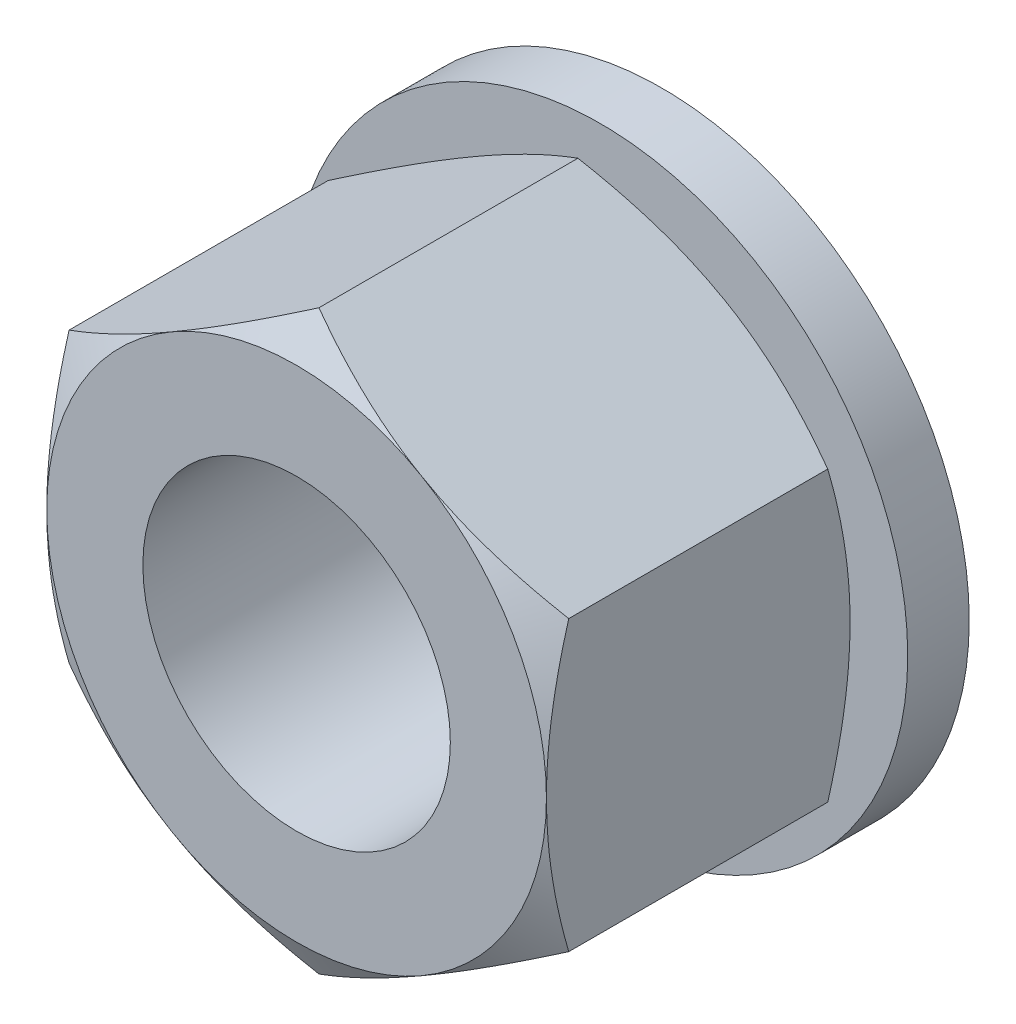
ISO-10303-21;
HEADER;
FILE_DESCRIPTION(('STEP AP214'),'2;1');
FILE_NAME('part.step','',(''),(''),'','','');
FILE_SCHEMA(('AUTOMOTIVE_DESIGN { 1 0 10303 214 1 1 1 1 }'));
ENDSEC;
DATA;
#1=APPLICATION_CONTEXT('core data for automotive mechanical design processes');
#2=APPLICATION_PROTOCOL_DEFINITION('international standard','automotive_design',2000,#1);
#3=PRODUCT_CONTEXT('',#1,'mechanical');
#4=PRODUCT('Part','Part','',(#3));
#5=PRODUCT_RELATED_PRODUCT_CATEGORY('part','',(#4));
#6=PRODUCT_DEFINITION_FORMATION('','',#4);
#7=PRODUCT_DEFINITION_CONTEXT('part definition',#1,'design');
#8=PRODUCT_DEFINITION('design','',#6,#7);
#9=PRODUCT_DEFINITION_SHAPE('','',#8);
#10=(LENGTH_UNIT() NAMED_UNIT(*) SI_UNIT(.MILLI.,.METRE.));
#11=(NAMED_UNIT(*) PLANE_ANGLE_UNIT() SI_UNIT($,.RADIAN.));
#12=(NAMED_UNIT(*) SI_UNIT($,.STERADIAN.) SOLID_ANGLE_UNIT());
#13=UNCERTAINTY_MEASURE_WITH_UNIT(LENGTH_MEASURE(1.E-05),#10,'distance_accuracy_value','');
#14=(GEOMETRIC_REPRESENTATION_CONTEXT(3) GLOBAL_UNCERTAINTY_ASSIGNED_CONTEXT((#13)) GLOBAL_UNIT_ASSIGNED_CONTEXT((#10,
#11,#12)) REPRESENTATION_CONTEXT('',''));
#15=CARTESIAN_POINT('',(0.,0.,0.));
#16=DIRECTION('',(0.,0.,1.));
#17=DIRECTION('',(1.,0.,0.));
#18=AXIS2_PLACEMENT_3D('',#15,#16,#17);
#19=CARTESIAN_POINT('',(6.5,3.75277674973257,9.5));
#20=DIRECTION('',(-0.5,-0.866025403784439,0.));
#21=DIRECTION('',(0.866025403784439,-0.5,0.));
#22=AXIS2_PLACEMENT_3D('',#19,#20,#21);
#23=PLANE('',#22);
#24=CARTESIAN_POINT('',(-0.000199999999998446,7.50566896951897,2.18062325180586));
#25=CARTESIAN_POINT('',(0.142677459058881,7.4231786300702,2.13300442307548));
#26=CARTESIAN_POINT('',(0.286087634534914,7.34038072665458,2.08754670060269));
#27=CARTESIAN_POINT('',(0.574072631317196,7.17411251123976,2.00154868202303));
#28=CARTESIAN_POINT('',(0.718647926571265,7.09064192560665,1.96101050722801));
#29=CARTESIAN_POINT('',(1.15468865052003,6.83889369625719,1.8475710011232));
#30=CARTESIAN_POINT('',(1.44787528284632,6.66962231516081,1.78304780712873));
#31=CARTESIAN_POINT('',(1.88662374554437,6.41631077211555,1.70738658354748));
#32=CARTESIAN_POINT('',(2.03087463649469,6.33302748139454,1.68583285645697));
#33=CARTESIAN_POINT('',(2.32002821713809,6.16608458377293,1.64969031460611));
#34=CARTESIAN_POINT('',(2.46493084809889,6.08242501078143,1.63510088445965));
#35=CARTESIAN_POINT('',(2.75498777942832,5.91496056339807,1.61325875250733));
#36=CARTESIAN_POINT('',(2.90014160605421,5.8311559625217,1.60599772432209));
#37=CARTESIAN_POINT('',(3.19057533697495,5.66347396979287,1.59896030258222));
#38=CARTESIAN_POINT('',(3.33585523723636,5.5795965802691,1.5991836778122));
#39=CARTESIAN_POINT('',(3.73387594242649,5.34979921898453,1.61008345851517));
#40=CARTESIAN_POINT('',(3.98648646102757,5.20395446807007,1.62838181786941));
#41=CARTESIAN_POINT('',(4.49002967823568,4.91323365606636,1.68640634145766));
#42=CARTESIAN_POINT('',(4.74096060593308,4.76835861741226,1.72615233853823));
#43=CARTESIAN_POINT('',(5.24551722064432,4.47705272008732,1.82550590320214));
#44=CARTESIAN_POINT('',(5.49907924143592,4.33065861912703,1.88553442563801));
#45=CARTESIAN_POINT('',(6.00242193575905,4.04005357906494,2.02177499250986));
#46=CARTESIAN_POINT('',(6.25220905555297,3.89583891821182,2.09795503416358));
#47=CARTESIAN_POINT('',(6.5002,3.75266127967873,2.18062325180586));
#48=B_SPLINE_CURVE_WITH_KNOTS('',3,(#24,#25,#26,#27,#28,#29,#30,#31,#32,#33,#34,#35,#36,#37,#38,
#39,#40,#41,#42,#43,#44,#45,#46,#47),.UNSPECIFIED.,.F.,.F.,(4,2,2,2,2,2,2,2,2,2,2,4),(0.,
0.515105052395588,1.03043143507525,2.06322554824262,2.56697389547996,3.07067772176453,
3.57380860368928,4.0769239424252,4.9527935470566,5.82947446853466,6.72559912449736,
7.61996451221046),.UNSPECIFIED.);
#49=CARTESIAN_POINT('',(0.,7.50555349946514,2.18055658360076));
#50=VERTEX_POINT('',#49);
#51=CARTESIAN_POINT('',(3.25,5.62916512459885,1.6));
#52=VERTEX_POINT('',#51);
#53=EDGE_CURVE('E118',#50,#52,#48,.T.);
#54=ORIENTED_EDGE('',*,*,#53,.F.);
#55=DIRECTION('',(0.,0.,-1.));
#56=VECTOR('',#55,1.);
#57=CARTESIAN_POINT('',(0.,7.50555349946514,9.5));
#58=LINE('',#57,#56);
#59=CARTESIAN_POINT('',(0.,7.50555349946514,8.91944341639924));
#60=VERTEX_POINT('',#59);
#61=EDGE_CURVE('E245',#60,#50,#58,.T.);
#62=ORIENTED_EDGE('',*,*,#61,.F.);
#63=CARTESIAN_POINT('',(6.5002,3.75266127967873,8.91937674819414));
#64=CARTESIAN_POINT('',(6.35732254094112,3.83515161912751,8.96699557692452));
#65=CARTESIAN_POINT('',(6.21391236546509,3.91794952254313,9.01245329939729));
#66=CARTESIAN_POINT('',(5.9259273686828,4.08421773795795,9.09845131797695));
#67=CARTESIAN_POINT('',(5.78135207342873,4.16768832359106,9.13898949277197));
#68=CARTESIAN_POINT('',(5.34531134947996,4.41943655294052,9.25242899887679));
#69=CARTESIAN_POINT('',(5.05212471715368,4.5887079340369,9.31695219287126));
#70=CARTESIAN_POINT('',(4.61337625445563,4.84201947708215,9.39261341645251));
#71=CARTESIAN_POINT('',(4.46912536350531,4.92530276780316,9.41416714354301));
#72=CARTESIAN_POINT('',(4.17997178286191,5.09224566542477,9.45030968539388));
#73=CARTESIAN_POINT('',(4.03506915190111,5.17590523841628,9.46489911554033));
#74=CARTESIAN_POINT('',(3.74501222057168,5.34336968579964,9.48674124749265));
#75=CARTESIAN_POINT('',(3.59985839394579,5.427174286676,9.49400227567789));
#76=CARTESIAN_POINT('',(3.30942466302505,5.59485627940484,9.50103969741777));
#77=CARTESIAN_POINT('',(3.16414476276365,5.67873366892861,9.50081632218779));
#78=CARTESIAN_POINT('',(2.76612405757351,5.90853103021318,9.48991654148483));
#79=CARTESIAN_POINT('',(2.51351353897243,6.05437578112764,9.47161818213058));
#80=CARTESIAN_POINT('',(2.00997032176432,6.34509659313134,9.41359365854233));
#81=CARTESIAN_POINT('',(1.75903939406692,6.48997163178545,9.37384766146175));
#82=CARTESIAN_POINT('',(1.25448277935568,6.78127752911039,9.27449409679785));
#83=CARTESIAN_POINT('',(1.00092075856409,6.92767163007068,9.21446557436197));
#84=CARTESIAN_POINT('',(0.497578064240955,7.21827667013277,9.07822500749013));
#85=CARTESIAN_POINT('',(0.247790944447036,7.36249133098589,9.00204496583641));
#86=CARTESIAN_POINT('',(-0.000199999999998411,7.50566896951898,8.91937674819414));
#87=B_SPLINE_CURVE_WITH_KNOTS('',3,(#63,#64,#65,#66,#67,#68,#69,#70,#71,#72,#73,#74,#75,#76,#77,
#78,#79,#80,#81,#82,#83,#84,#85,#86),.UNSPECIFIED.,.F.,.F.,(4,2,2,2,2,2,2,2,2,2,2,4),(0.,
0.515105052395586,1.03043143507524,2.06322554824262,2.56697389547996,3.07067772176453,
3.57380860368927,4.07692394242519,4.9527935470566,5.82947446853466,6.72559912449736,
7.61996451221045),.UNSPECIFIED.);
#88=CARTESIAN_POINT('',(3.25,5.62916512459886,9.5));
#89=VERTEX_POINT('',#88);
#90=EDGE_CURVE('E219',#89,#60,#87,.T.);
#91=ORIENTED_EDGE('',*,*,#90,.F.);
#92=CARTESIAN_POINT('',(6.5,3.75277674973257,8.91944341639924));
#93=VERTEX_POINT('',#92);
#94=EDGE_CURVE('E225',#93,#89,#87,.T.);
#95=ORIENTED_EDGE('',*,*,#94,.F.);
#96=DIRECTION('',(0.,0.,-1.));
#97=VECTOR('',#96,1.);
#98=CARTESIAN_POINT('',(6.5,3.75277674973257,9.5));
#99=LINE('',#98,#97);
#100=CARTESIAN_POINT('',(6.5,3.75277674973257,2.18055658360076));
#101=VERTEX_POINT('',#100);
#102=EDGE_CURVE('E137',#93,#101,#99,.T.);
#103=ORIENTED_EDGE('',*,*,#102,.T.);
#104=EDGE_CURVE('E126',#52,#101,#48,.T.);
#105=ORIENTED_EDGE('',*,*,#104,.F.);
#106=EDGE_LOOP('',(#54,#62,#91,#95,#103,#105));
#107=FACE_BOUND('',#106,.T.);
#108=ADVANCED_FACE('F14',(#107),#23,.F.);
#109=CARTESIAN_POINT('',(0.,7.50555349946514,9.5));
#110=DIRECTION('',(0.5,-0.866025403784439,0.));
#111=DIRECTION('',(0.866025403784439,0.5,0.));
#112=AXIS2_PLACEMENT_3D('',#109,#110,#111);
#113=PLANE('',#112);
#114=CARTESIAN_POINT('',(-6.5002,3.75266127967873,2.18062325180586));
#115=CARTESIAN_POINT('',(-6.35732254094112,3.83515161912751,2.13300442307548));
#116=CARTESIAN_POINT('',(-6.21391236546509,3.91794952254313,2.0875467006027));
#117=CARTESIAN_POINT('',(-5.92592736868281,4.08421773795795,2.00154868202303));
#118=CARTESIAN_POINT('',(-5.78135207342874,4.16768832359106,1.96101050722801));
#119=CARTESIAN_POINT('',(-5.34531134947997,4.41943655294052,1.8475710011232));
#120=CARTESIAN_POINT('',(-5.05212471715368,4.5887079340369,1.78304780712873));
#121=CARTESIAN_POINT('',(-4.61337625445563,4.84201947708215,1.70738658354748));
#122=CARTESIAN_POINT('',(-4.46912536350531,4.92530276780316,1.68583285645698));
#123=CARTESIAN_POINT('',(-4.17997178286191,5.09224566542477,1.64969031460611));
#124=CARTESIAN_POINT('',(-4.03506915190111,5.17590523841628,1.63510088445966));
#125=CARTESIAN_POINT('',(-3.74501222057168,5.34336968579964,1.61325875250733));
#126=CARTESIAN_POINT('',(-3.59985839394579,5.427174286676,1.60599772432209));
#127=CARTESIAN_POINT('',(-3.30942466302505,5.59485627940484,1.59896030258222));
#128=CARTESIAN_POINT('',(-3.16414476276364,5.67873366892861,1.59918367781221));
#129=CARTESIAN_POINT('',(-2.76612405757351,5.90853103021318,1.61008345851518));
#130=CARTESIAN_POINT('',(-2.51351353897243,6.05437578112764,1.62838181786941));
#131=CARTESIAN_POINT('',(-2.00997032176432,6.34509659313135,1.68640634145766));
#132=CARTESIAN_POINT('',(-1.75903939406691,6.48997163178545,1.72615233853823));
#133=CARTESIAN_POINT('',(-1.25448277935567,6.78127752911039,1.82550590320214));
#134=CARTESIAN_POINT('',(-1.00092075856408,6.92767163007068,1.88553442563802));
#135=CARTESIAN_POINT('',(-0.497578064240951,7.21827667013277,2.02177499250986));
#136=CARTESIAN_POINT('',(-0.247790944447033,7.36249133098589,2.09795503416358));
#137=CARTESIAN_POINT('',(0.000200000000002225,7.50566896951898,2.18062325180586));
#138=B_SPLINE_CURVE_WITH_KNOTS('',3,(#114,#115,#116,#117,#118,#119,#120,#121,#122,#123,#124,
#125,#126,#127,#128,#129,#130,#131,#132,#133,#134,#135,#136,#137),.UNSPECIFIED.,.F.,.F.,(4,2,2,
2,2,2,2,2,2,2,2,4),(0.,0.515105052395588,1.03043143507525,2.06322554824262,2.56697389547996,
3.07067772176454,3.57380860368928,4.0769239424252,4.95279354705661,5.82947446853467,
6.72559912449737,7.61996451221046),.UNSPECIFIED.);
#139=CARTESIAN_POINT('',(-6.5,3.75277674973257,2.18055658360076));
#140=VERTEX_POINT('',#139);
#141=CARTESIAN_POINT('',(-3.25,5.62916512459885,1.6));
#142=VERTEX_POINT('',#141);
#143=EDGE_CURVE('E188',#140,#142,#138,.T.);
#144=ORIENTED_EDGE('',*,*,#143,.F.);
#145=DIRECTION('',(0.,0.,-1.));
#146=VECTOR('',#145,1.);
#147=CARTESIAN_POINT('',(-6.5,3.75277674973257,9.5));
#148=LINE('',#147,#146);
#149=CARTESIAN_POINT('',(-6.5,3.75277674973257,8.91944341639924));
#150=VERTEX_POINT('',#149);
#151=EDGE_CURVE('E242',#150,#140,#148,.T.);
#152=ORIENTED_EDGE('',*,*,#151,.F.);
#153=CARTESIAN_POINT('',(0.000200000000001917,7.50566896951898,8.91937674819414));
#154=CARTESIAN_POINT('',(-0.142677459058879,7.4231786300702,8.96699557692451));
#155=CARTESIAN_POINT('',(-0.286087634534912,7.34038072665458,9.01245329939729));
#156=CARTESIAN_POINT('',(-0.574072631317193,7.17411251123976,9.09845131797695));
#157=CARTESIAN_POINT('',(-0.718647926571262,7.09064192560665,9.13898949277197));
#158=CARTESIAN_POINT('',(-1.15468865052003,6.83889369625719,9.25242899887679));
#159=CARTESIAN_POINT('',(-1.44787528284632,6.66962231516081,9.31695219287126));
#160=CARTESIAN_POINT('',(-1.88662374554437,6.41631077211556,9.39261341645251));
#161=CARTESIAN_POINT('',(-2.03087463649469,6.33302748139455,9.41416714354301));
#162=CARTESIAN_POINT('',(-2.32002821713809,6.16608458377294,9.45030968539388));
#163=CARTESIAN_POINT('',(-2.46493084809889,6.08242501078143,9.46489911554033));
#164=CARTESIAN_POINT('',(-2.75498777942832,5.91496056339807,9.48674124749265));
#165=CARTESIAN_POINT('',(-2.90014160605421,5.83115596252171,9.49400227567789));
#166=CARTESIAN_POINT('',(-3.19057533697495,5.66347396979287,9.50103969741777));
#167=CARTESIAN_POINT('',(-3.33585523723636,5.57959658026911,9.5008163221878));
#168=CARTESIAN_POINT('',(-3.73387594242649,5.34979921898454,9.48991654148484));
#169=CARTESIAN_POINT('',(-3.98648646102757,5.20395446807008,9.47161818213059));
#170=CARTESIAN_POINT('',(-4.49002967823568,4.91323365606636,9.41359365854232));
#171=CARTESIAN_POINT('',(-4.74096060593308,4.76835861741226,9.37384766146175));
#172=CARTESIAN_POINT('',(-5.24551722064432,4.47705272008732,9.27449409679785));
#173=CARTESIAN_POINT('',(-5.49907924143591,4.33065861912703,9.21446557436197));
#174=CARTESIAN_POINT('',(-6.00242193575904,4.04005357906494,9.07822500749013));
#175=CARTESIAN_POINT('',(-6.25220905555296,3.89583891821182,9.00204496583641));
#176=CARTESIAN_POINT('',(-6.5002,3.75266127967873,8.91937674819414));
#177=B_SPLINE_CURVE_WITH_KNOTS('',3,(#153,#154,#155,#156,#157,#158,#159,#160,#161,#162,#163,
#164,#165,#166,#167,#168,#169,#170,#171,#172,#173,#174,#175,#176),.UNSPECIFIED.,.F.,.F.,(4,2,2,
2,2,2,2,2,2,2,2,4),(0.,0.515105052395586,1.03043143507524,2.06322554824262,2.56697389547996,
3.07067772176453,3.57380860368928,4.0769239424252,4.9527935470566,5.82947446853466,
6.72559912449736,7.61996451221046),.UNSPECIFIED.);
#178=CARTESIAN_POINT('',(-3.25,5.62916512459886,9.5));
#179=VERTEX_POINT('',#178);
#180=EDGE_CURVE('E204',#179,#150,#177,.T.);
#181=ORIENTED_EDGE('',*,*,#180,.F.);
#182=EDGE_CURVE('E211',#60,#179,#177,.T.);
#183=ORIENTED_EDGE('',*,*,#182,.F.);
#184=ORIENTED_EDGE('',*,*,#61,.T.);
#185=EDGE_CURVE('E120',#142,#50,#138,.T.);
#186=ORIENTED_EDGE('',*,*,#185,.F.);
#187=EDGE_LOOP('',(#144,#152,#181,#183,#184,#186));
#188=FACE_BOUND('',#187,.T.);
#189=ADVANCED_FACE('F196',(#188),#113,.F.);
#190=CARTESIAN_POINT('',(-6.5,3.75277674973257,9.5));
#191=DIRECTION('',(1.,0.,0.));
#192=DIRECTION('',(0.,0.,-1.));
#193=AXIS2_PLACEMENT_3D('',#190,#191,#192);
#194=PLANE('',#193);
#195=CARTESIAN_POINT('',(-6.5,-10.0575950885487,4.76110346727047));
#196=CARTESIAN_POINT('',(-6.5,-9.7738931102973,4.62357449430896));
#197=CARTESIAN_POINT('',(-6.5,-9.48953742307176,4.48737080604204));
#198=CARTESIAN_POINT('',(-6.5,-8.91917092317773,4.2183598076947));
#199=CARTESIAN_POINT('',(-6.5,-8.63315985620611,4.08555303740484));
#200=CARTESIAN_POINT('',(-6.5,-8.05765024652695,3.82340862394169));
#201=CARTESIAN_POINT('',(-6.5,-7.76814117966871,3.69409400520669));
#202=CARTESIAN_POINT('',(-6.5,-7.18681242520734,3.4407871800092));
#203=CARTESIAN_POINT('',(-6.5,-6.89499284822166,3.31679472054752));
#204=CARTESIAN_POINT('',(-6.5,-6.29923726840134,3.07169472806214));
#205=CARTESIAN_POINT('',(-6.5,-5.99521128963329,2.95080470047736));
#206=CARTESIAN_POINT('',(-6.5,-5.3835936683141,2.71822954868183));
#207=CARTESIAN_POINT('',(-6.5,-5.07600162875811,2.60654546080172));
#208=CARTESIAN_POINT('',(-6.5,-4.45734692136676,2.39533058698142));
#209=CARTESIAN_POINT('',(-6.5,-4.14629280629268,2.29577499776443));
#210=CARTESIAN_POINT('',(-6.5,-3.51971945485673,2.1120279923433));
#211=CARTESIAN_POINT('',(-6.5,-3.20420166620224,2.02783171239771));
#212=CARTESIAN_POINT('',(-6.5,-2.57029031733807,1.87930323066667));
#213=CARTESIAN_POINT('',(-6.5,-2.2519222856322,1.81486382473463));
#214=CARTESIAN_POINT('',(-6.5,-1.61120601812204,1.70952009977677));
#215=CARTESIAN_POINT('',(-6.5,-1.28885815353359,1.66861360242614));
#216=CARTESIAN_POINT('',(-6.5,-0.805775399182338,1.62762027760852));
#217=CARTESIAN_POINT('',(-6.5,-0.645864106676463,1.61735247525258));
#218=CARTESIAN_POINT('',(-6.5,-0.32574357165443,1.60358106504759));
#219=CARTESIAN_POINT('',(-6.5,-0.165534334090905,1.60007734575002));
#220=CARTESIAN_POINT('',(-6.5,0.154886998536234,1.59992517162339));
#221=CARTESIAN_POINT('',(-6.5,0.315099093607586,1.60327673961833));
#222=CARTESIAN_POINT('',(-6.5,0.635240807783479,1.61675159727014));
#223=CARTESIAN_POINT('',(-6.5,0.795170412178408,1.62687522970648));
#224=CARTESIAN_POINT('',(-6.5,1.18023405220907,1.65918992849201));
#225=CARTESIAN_POINT('',(-6.5,1.40510076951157,1.68463348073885));
#226=CARTESIAN_POINT('',(-6.5,1.85313960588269,1.74751574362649));
#227=CARTESIAN_POINT('',(-6.5,2.07631148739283,1.78495610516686));
#228=CARTESIAN_POINT('',(-6.5,2.74304479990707,1.91328499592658));
#229=CARTESIAN_POINT('',(-6.5,3.18356905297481,2.02015713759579));
#230=CARTESIAN_POINT('',(-6.5,3.84221913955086,2.20515638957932));
#231=CARTESIAN_POINT('',(-6.5,4.06376991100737,2.2717883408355));
#232=CARTESIAN_POINT('',(-6.5,4.50471914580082,2.41189254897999));
#233=CARTESIAN_POINT('',(-6.5,4.72411759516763,2.48536485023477));
#234=CARTESIAN_POINT('',(-6.5,5.16083253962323,2.63797764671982));
#235=CARTESIAN_POINT('',(-6.5,5.37814971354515,2.7171162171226));
#236=CARTESIAN_POINT('',(-6.5,5.8109891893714,2.88013846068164));
#237=CARTESIAN_POINT('',(-6.5,6.02651151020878,2.96402208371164));
#238=CARTESIAN_POINT('',(-6.5,6.52637385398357,3.16390138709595));
#239=CARTESIAN_POINT('',(-6.5,6.81010843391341,3.2814081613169));
#240=CARTESIAN_POINT('',(-6.5,7.37523072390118,3.52195138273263));
#241=CARTESIAN_POINT('',(-6.5,7.65661830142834,3.64498813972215));
#242=CARTESIAN_POINT('',(-6.5,8.2174660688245,3.89550628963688));
#243=CARTESIAN_POINT('',(-6.5,8.49692588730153,4.02298851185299));
#244=CARTESIAN_POINT('',(-6.5,9.0541894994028,4.28152871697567));
#245=CARTESIAN_POINT('',(-6.5,9.33199325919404,4.41258677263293));
#246=CARTESIAN_POINT('',(-6.5,9.88648491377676,4.67775341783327));
#247=CARTESIAN_POINT('',(-6.5,10.1631713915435,4.81186496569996));
#248=CARTESIAN_POINT('',(-6.5,10.71536256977,5.08250149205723));
#249=CARTESIAN_POINT('',(-6.5,10.9908672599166,5.21902649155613));
#250=CARTESIAN_POINT('',(-6.5,11.8158166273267,5.63155840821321));
#251=CARTESIAN_POINT('',(-6.5,12.3637658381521,5.91055562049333));
#252=CARTESIAN_POINT('',(-6.5,13.4123157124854,6.45128346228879));
#253=CARTESIAN_POINT('',(-6.5,13.9131443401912,6.71257398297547));
#254=CARTESIAN_POINT('',(-6.5,14.9129223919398,7.23876275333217));
#255=CARTESIAN_POINT('',(-6.5,15.4118717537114,7.50366112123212));
#256=CARTESIAN_POINT('',(-6.5,16.4071100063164,8.03557983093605));
#257=CARTESIAN_POINT('',(-6.5,16.9034024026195,8.30259362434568));
#258=CARTESIAN_POINT('',(-6.5,17.8947801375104,8.83879133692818));
#259=CARTESIAN_POINT('',(-6.5,18.3898655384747,9.10797514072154));
#260=CARTESIAN_POINT('',(-6.5,18.8845041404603,9.37797194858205));
#261=B_SPLINE_CURVE_WITH_KNOTS('',3,(#195,#196,#197,#198,#199,#200,#201,#202,#203,#204,#205,
#206,#207,#208,#209,#210,#211,#212,#213,#214,#215,#216,#217,#218,#219,#220,#221,#222,#223,#224,
#225,#226,#227,#228,#229,#230,#231,#232,#233,#234,#235,#236,#237,#238,#239,#240,#241,#242,#243,
#244,#245,#246,#247,#248,#249,#250,#251,#252,#253,#254,#255,#256,#257,#258,#259,#260),
.UNSPECIFIED.,.F.,.F.,(4,2,2,2,2,2,2,2,2,2,2,2,2,2,2,2,2,2,2,2,2,2,2,2,2,2,2,2,2,2,2,2,4),(0.,
0.945849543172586,1.89184846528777,2.84303633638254,3.79417894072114,4.775601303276,
5.75713399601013,6.73662446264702,7.71580421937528,8.68957270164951,9.66325103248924,
10.1438514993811,10.6244440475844,11.1050381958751,11.5856566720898,12.2641776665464,
12.9427920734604,14.3007854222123,14.9947898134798,15.6887987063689,16.3825729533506,
17.0763398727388,17.9975752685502,18.9188623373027,19.8403221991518,20.7618008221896,
21.6842137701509,22.6066347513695,24.451246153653,26.1459039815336,27.8406174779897,
29.5312987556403,31.221890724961),.UNSPECIFIED.);
#262=CARTESIAN_POINT('',(-6.5,-3.75277674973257,2.18055658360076));
#263=VERTEX_POINT('',#262);
#264=CARTESIAN_POINT('',(-6.5,0.,1.6));
#265=VERTEX_POINT('',#264);
#266=EDGE_CURVE('E472',#263,#265,#261,.T.);
#267=ORIENTED_EDGE('',*,*,#266,.F.);
#268=DIRECTION('',(0.,0.,-1.));
#269=VECTOR('',#268,1.);
#270=CARTESIAN_POINT('',(-6.5,-3.75277674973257,9.5));
#271=LINE('',#270,#269);
#272=CARTESIAN_POINT('',(-6.5,-3.75277674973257,8.91944341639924));
#273=VERTEX_POINT('',#272);
#274=EDGE_CURVE('E239',#273,#263,#271,.T.);
#275=ORIENTED_EDGE('',*,*,#274,.F.);
#276=CARTESIAN_POINT('',(-6.5,-10.1097313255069,6.31359650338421));
#277=CARTESIAN_POINT('',(-6.5,-9.82559293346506,6.45154670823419));
#278=CARTESIAN_POINT('',(-6.5,-9.54080543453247,6.58818267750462));
#279=CARTESIAN_POINT('',(-6.5,-8.9695871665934,6.85808760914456));
#280=CARTESIAN_POINT('',(-6.5,-8.68315614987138,6.99135604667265));
#281=CARTESIAN_POINT('',(-6.5,-8.10684397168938,7.25445161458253));
#282=CARTESIAN_POINT('',(-6.5,-7.81695253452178,7.38425631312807));
#283=CARTESIAN_POINT('',(-6.5,-7.23487426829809,7.63859294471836));
#284=CARTESIAN_POINT('',(-6.5,-6.94268754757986,7.76312512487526));
#285=CARTESIAN_POINT('',(-6.5,-6.34599668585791,8.00947161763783));
#286=CARTESIAN_POINT('',(-6.5,-6.04140110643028,8.13106564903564));
#287=CARTESIAN_POINT('',(-6.5,-5.42865687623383,8.36512173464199));
#288=CARTESIAN_POINT('',(-6.5,-5.12050783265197,8.47758276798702));
#289=CARTESIAN_POINT('',(-6.5,-4.50073503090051,8.69044225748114));
#290=CARTESIAN_POINT('',(-6.5,-4.18911965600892,8.79086488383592));
#291=CARTESIAN_POINT('',(-6.5,-3.56141541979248,8.9764432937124));
#292=CARTESIAN_POINT('',(-6.5,-3.2453279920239,9.06160385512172));
#293=CARTESIAN_POINT('',(-6.5,-2.61028406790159,9.21213758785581));
#294=CARTESIAN_POINT('',(-6.5,-2.29135378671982,9.27761958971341));
#295=CARTESIAN_POINT('',(-6.5,-1.64945098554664,9.38510401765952));
#296=CARTESIAN_POINT('',(-6.5,-1.3264788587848,9.42710870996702));
#297=CARTESIAN_POINT('',(-6.5,-0.842423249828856,9.46971990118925));
#298=CARTESIAN_POINT('',(-6.5,-0.682197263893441,9.48051862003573));
#299=CARTESIAN_POINT('',(-6.5,-0.36142505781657,9.49533485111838));
#300=CARTESIAN_POINT('',(-6.5,-0.200878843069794,9.49935247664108));
#301=CARTESIAN_POINT('',(-6.5,0.120237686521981,9.50050312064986));
#302=CARTESIAN_POINT('',(-6.5,0.280808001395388,9.4976361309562));
#303=CARTESIAN_POINT('',(-6.5,0.601684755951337,9.48509003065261));
#304=CARTESIAN_POINT('',(-6.5,0.761991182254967,9.47541058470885));
#305=CARTESIAN_POINT('',(-6.5,1.14637822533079,9.4442382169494));
#306=CARTESIAN_POINT('',(-6.5,1.37020612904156,9.41956152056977));
#307=CARTESIAN_POINT('',(-6.5,1.816209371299,9.35826605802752));
#308=CARTESIAN_POINT('',(-6.5,2.03838448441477,9.3216456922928));
#309=CARTESIAN_POINT('',(-6.5,2.70217248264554,9.19581004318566));
#310=CARTESIAN_POINT('',(-6.5,3.14080181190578,9.09064282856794));
#311=CARTESIAN_POINT('',(-6.5,3.7966876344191,8.90816293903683));
#312=CARTESIAN_POINT('',(-6.5,4.01734354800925,8.84236494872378));
#313=CARTESIAN_POINT('',(-6.5,4.456512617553,8.70390587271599));
#314=CARTESIAN_POINT('',(-6.5,4.6750257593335,8.63124474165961));
#315=CARTESIAN_POINT('',(-6.5,5.10997720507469,8.48022758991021));
#316=CARTESIAN_POINT('',(-6.5,5.32641616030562,8.40187342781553));
#317=CARTESIAN_POINT('',(-6.5,5.75749910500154,8.24039499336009));
#318=CARTESIAN_POINT('',(-6.5,5.97214311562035,8.15727077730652));
#319=CARTESIAN_POINT('',(-6.5,6.47902096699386,7.95552624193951));
#320=CARTESIAN_POINT('',(-6.5,6.77055804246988,7.83515855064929));
#321=CARTESIAN_POINT('',(-6.5,7.35114153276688,7.5885419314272));
#322=CARTESIAN_POINT('',(-6.5,7.64018779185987,7.46229263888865));
#323=CARTESIAN_POINT('',(-6.5,8.21624766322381,7.20509454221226));
#324=CARTESIAN_POINT('',(-6.5,8.5032608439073,7.07414477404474));
#325=CARTESIAN_POINT('',(-6.5,9.07554587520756,6.80848717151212));
#326=CARTESIAN_POINT('',(-6.5,9.36081768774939,6.67377925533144));
#327=CARTESIAN_POINT('',(-6.5,9.93020788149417,6.40116657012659));
#328=CARTESIAN_POINT('',(-6.5,10.2143246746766,6.26325848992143));
#329=CARTESIAN_POINT('',(-6.5,10.7813262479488,5.98493015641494));
#330=CARTESIAN_POINT('',(-6.5,11.0642110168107,5.84450988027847));
#331=CARTESIAN_POINT('',(-6.5,11.9112351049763,5.42018792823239));
#332=CARTESIAN_POINT('',(-6.5,12.4738219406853,5.13318759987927));
#333=CARTESIAN_POINT('',(-6.5,13.5487483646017,4.57778682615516));
#334=CARTESIAN_POINT('',(-6.5,14.0613309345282,4.30985453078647));
#335=CARTESIAN_POINT('',(-6.5,15.0845811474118,3.77031619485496));
#336=CARTESIAN_POINT('',(-6.5,15.5952487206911,3.49871002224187));
#337=CARTESIAN_POINT('',(-6.5,16.6137990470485,2.95339191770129));
#338=CARTESIAN_POINT('',(-6.5,17.1216855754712,2.67968702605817));
#339=CARTESIAN_POINT('',(-6.5,18.1362343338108,2.13008411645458));
#340=CARTESIAN_POINT('',(-6.5,18.6428966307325,1.85418622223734));
#341=CARTESIAN_POINT('',(-6.5,19.1491085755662,1.57747005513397));
#342=B_SPLINE_CURVE_WITH_KNOTS('',3,(#276,#277,#278,#279,#280,#281,#282,#283,#284,#285,#286,
#287,#288,#289,#290,#291,#292,#293,#294,#295,#296,#297,#298,#299,#300,#301,#302,#303,#304,#305,
#306,#307,#308,#309,#310,#311,#312,#313,#314,#315,#316,#317,#318,#319,#320,#321,#322,#323,#324,
#325,#326,#327,#328,#329,#330,#331,#332,#333,#334,#335,#336,#337,#338,#339,#340,#341),
.UNSPECIFIED.,.F.,.F.,(4,2,2,2,2,2,2,2,2,2,2,2,2,2,2,2,2,2,2,2,2,2,2,2,2,2,2,2,2,2,2,2,4),(0.,
0.947578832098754,1.89530444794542,2.8481405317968,3.80093190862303,4.78472541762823,
5.76862874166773,6.75052231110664,7.73210795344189,8.70816065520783,9.68411912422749,
10.1657658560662,10.6474045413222,11.1290437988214,11.6107067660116,12.2858781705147,
12.9611400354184,14.312402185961,15.0031158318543,15.6938340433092,16.3843277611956,
17.0748133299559,18.0209504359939,18.9671462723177,19.9135372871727,20.8599489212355,
21.8073877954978,22.7548352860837,24.6494713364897,26.3846089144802,28.1198090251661,
29.8506319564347,31.5813579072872),.UNSPECIFIED.);
#343=CARTESIAN_POINT('',(-6.5,0.,9.5));
#344=VERTEX_POINT('',#343);
#345=EDGE_CURVE('E213',#344,#273,#342,.F.);
#346=ORIENTED_EDGE('',*,*,#345,.F.);
#347=EDGE_CURVE('E212',#150,#344,#342,.F.);
#348=ORIENTED_EDGE('',*,*,#347,.F.);
#349=ORIENTED_EDGE('',*,*,#151,.T.);
#350=EDGE_CURVE('E189',#265,#140,#261,.T.);
#351=ORIENTED_EDGE('',*,*,#350,.F.);
#352=EDGE_LOOP('',(#267,#275,#346,#348,#349,#351));
#353=FACE_BOUND('',#352,.T.);
#354=ADVANCED_FACE('F199',(#353),#194,.F.);
#355=CARTESIAN_POINT('',(-6.5,-3.75277674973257,9.5));
#356=DIRECTION('',(0.5,0.866025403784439,0.));
#357=DIRECTION('',(-0.866025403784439,0.5,0.));
#358=AXIS2_PLACEMENT_3D('',#355,#356,#357);
#359=PLANE('',#358);
#360=CARTESIAN_POINT('',(0.000199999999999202,-7.50566896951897,2.18062325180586));
#361=CARTESIAN_POINT('',(-0.142677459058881,-7.4231786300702,2.13300442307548));
#362=CARTESIAN_POINT('',(-0.286087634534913,-7.34038072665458,2.08754670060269));
#363=CARTESIAN_POINT('',(-0.574072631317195,-7.17411251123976,2.00154868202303));
#364=CARTESIAN_POINT('',(-0.718647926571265,-7.09064192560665,1.96101050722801));
#365=CARTESIAN_POINT('',(-1.15468865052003,-6.83889369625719,1.8475710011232));
#366=CARTESIAN_POINT('',(-1.44787528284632,-6.66962231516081,1.78304780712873));
#367=CARTESIAN_POINT('',(-1.88662374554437,-6.41631077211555,1.70738658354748));
#368=CARTESIAN_POINT('',(-2.03087463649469,-6.33302748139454,1.68583285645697));
#369=CARTESIAN_POINT('',(-2.32002821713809,-6.16608458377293,1.64969031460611));
#370=CARTESIAN_POINT('',(-2.46493084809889,-6.08242501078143,1.63510088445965));
#371=CARTESIAN_POINT('',(-2.75498777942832,-5.91496056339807,1.61325875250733));
#372=CARTESIAN_POINT('',(-2.90014160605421,-5.8311559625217,1.60599772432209));
#373=CARTESIAN_POINT('',(-3.19057533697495,-5.66347396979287,1.59896030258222));
#374=CARTESIAN_POINT('',(-3.33585523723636,-5.5795965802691,1.5991836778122));
#375=CARTESIAN_POINT('',(-3.73387594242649,-5.34979921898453,1.61008345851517));
#376=CARTESIAN_POINT('',(-3.98648646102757,-5.20395446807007,1.62838181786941));
#377=CARTESIAN_POINT('',(-4.49002967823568,-4.91323365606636,1.68640634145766));
#378=CARTESIAN_POINT('',(-4.74096060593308,-4.76835861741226,1.72615233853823));
#379=CARTESIAN_POINT('',(-5.24551722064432,-4.47705272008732,1.82550590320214));
#380=CARTESIAN_POINT('',(-5.49907924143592,-4.33065861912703,1.88553442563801));
#381=CARTESIAN_POINT('',(-6.00242193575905,-4.04005357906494,2.02177499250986));
#382=CARTESIAN_POINT('',(-6.25220905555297,-3.89583891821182,2.09795503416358));
#383=CARTESIAN_POINT('',(-6.5002,-3.75266127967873,2.18062325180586));
#384=B_SPLINE_CURVE_WITH_KNOTS('',3,(#360,#361,#362,#363,#364,#365,#366,#367,#368,#369,#370,
#371,#372,#373,#374,#375,#376,#377,#378,#379,#380,#381,#382,#383),.UNSPECIFIED.,.F.,.F.,(4,2,2,
2,2,2,2,2,2,2,2,4),(0.,0.515105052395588,1.03043143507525,2.06322554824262,2.56697389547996,
3.07067772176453,3.57380860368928,4.0769239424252,4.9527935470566,5.82947446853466,
6.72559912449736,7.61996451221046),.UNSPECIFIED.);
#385=CARTESIAN_POINT('',(0.,-7.50555349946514,2.18055658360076));
#386=VERTEX_POINT('',#385);
#387=CARTESIAN_POINT('',(-3.25,-5.62916512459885,1.6));
#388=VERTEX_POINT('',#387);
#389=EDGE_CURVE('E154',#386,#388,#384,.T.);
#390=ORIENTED_EDGE('',*,*,#389,.F.);
#391=DIRECTION('',(0.,0.,-1.));
#392=VECTOR('',#391,1.);
#393=CARTESIAN_POINT('',(0.,-7.50555349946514,9.5));
#394=LINE('',#393,#392);
#395=CARTESIAN_POINT('',(0.,-7.50555349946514,8.91944341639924));
#396=VERTEX_POINT('',#395);
#397=EDGE_CURVE('E236',#396,#386,#394,.T.);
#398=ORIENTED_EDGE('',*,*,#397,.F.);
#399=CARTESIAN_POINT('',(-6.5002,-3.75266127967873,8.91937674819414));
#400=CARTESIAN_POINT('',(-6.35732254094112,-3.83515161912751,8.96699557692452));
#401=CARTESIAN_POINT('',(-6.21391236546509,-3.91794952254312,9.01245329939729));
#402=CARTESIAN_POINT('',(-5.92592736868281,-4.08421773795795,9.09845131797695));
#403=CARTESIAN_POINT('',(-5.78135207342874,-4.16768832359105,9.13898949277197));
#404=CARTESIAN_POINT('',(-5.34531134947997,-4.41943655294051,9.25242899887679));
#405=CARTESIAN_POINT('',(-5.05212471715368,-4.5887079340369,9.31695219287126));
#406=CARTESIAN_POINT('',(-4.61337625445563,-4.84201947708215,9.39261341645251));
#407=CARTESIAN_POINT('',(-4.46912536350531,-4.92530276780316,9.41416714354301));
#408=CARTESIAN_POINT('',(-4.17997178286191,-5.09224566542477,9.45030968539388));
#409=CARTESIAN_POINT('',(-4.03506915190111,-5.17590523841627,9.46489911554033));
#410=CARTESIAN_POINT('',(-3.74501222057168,-5.34336968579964,9.48674124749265));
#411=CARTESIAN_POINT('',(-3.59985839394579,-5.427174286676,9.49400227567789));
#412=CARTESIAN_POINT('',(-3.30942466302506,-5.59485627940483,9.50103969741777));
#413=CARTESIAN_POINT('',(-3.16414476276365,-5.6787336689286,9.5008163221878));
#414=CARTESIAN_POINT('',(-2.76612405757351,-5.90853103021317,9.48991654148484));
#415=CARTESIAN_POINT('',(-2.51351353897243,-6.05437578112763,9.47161818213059));
#416=CARTESIAN_POINT('',(-2.00997032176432,-6.34509659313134,9.41359365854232));
#417=CARTESIAN_POINT('',(-1.75903939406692,-6.48997163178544,9.37384766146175));
#418=CARTESIAN_POINT('',(-1.25448277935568,-6.78127752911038,9.27449409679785));
#419=CARTESIAN_POINT('',(-1.00092075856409,-6.92767163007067,9.21446557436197));
#420=CARTESIAN_POINT('',(-0.497578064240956,-7.21827667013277,9.07822500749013));
#421=CARTESIAN_POINT('',(-0.247790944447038,-7.36249133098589,9.00204496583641));
#422=CARTESIAN_POINT('',(0.000199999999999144,-7.50566896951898,8.91937674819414));
#423=B_SPLINE_CURVE_WITH_KNOTS('',3,(#399,#400,#401,#402,#403,#404,#405,#406,#407,#408,#409,
#410,#411,#412,#413,#414,#415,#416,#417,#418,#419,#420,#421,#422),.UNSPECIFIED.,.F.,.F.,(4,2,2,
2,2,2,2,2,2,2,2,4),(0.,0.515105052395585,1.03043143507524,2.06322554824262,2.56697389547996,
3.07067772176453,3.57380860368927,4.07692394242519,4.95279354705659,5.82947446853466,
6.72559912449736,7.61996451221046),.UNSPECIFIED.);
#424=CARTESIAN_POINT('',(-3.25,-5.62916512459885,9.5));
#425=VERTEX_POINT('',#424);
#426=EDGE_CURVE('E484',#425,#396,#423,.T.);
#427=ORIENTED_EDGE('',*,*,#426,.F.);
#428=EDGE_CURVE('E481',#273,#425,#423,.T.);
#429=ORIENTED_EDGE('',*,*,#428,.F.);
#430=ORIENTED_EDGE('',*,*,#274,.T.);
#431=EDGE_CURVE('E473',#388,#263,#384,.T.);
#432=ORIENTED_EDGE('',*,*,#431,.F.);
#433=EDGE_LOOP('',(#390,#398,#427,#429,#430,#432));
#434=FACE_BOUND('',#433,.T.);
#435=ADVANCED_FACE('F296',(#434),#359,.F.);
#436=CARTESIAN_POINT('',(0.,-7.50555349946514,9.5));
#437=DIRECTION('',(-0.5,0.866025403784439,0.));
#438=DIRECTION('',(-0.866025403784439,-0.5,0.));
#439=AXIS2_PLACEMENT_3D('',#436,#437,#438);
#440=PLANE('',#439);
#441=CARTESIAN_POINT('',(6.5002,-3.75266127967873,2.18062325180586));
#442=CARTESIAN_POINT('',(6.35732254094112,-3.83515161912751,2.13300442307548));
#443=CARTESIAN_POINT('',(6.21391236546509,-3.91794952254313,2.0875467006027));
#444=CARTESIAN_POINT('',(5.92592736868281,-4.08421773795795,2.00154868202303));
#445=CARTESIAN_POINT('',(5.78135207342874,-4.16768832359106,1.96101050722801));
#446=CARTESIAN_POINT('',(5.34531134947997,-4.41943655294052,1.8475710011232));
#447=CARTESIAN_POINT('',(5.05212471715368,-4.5887079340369,1.78304780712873));
#448=CARTESIAN_POINT('',(4.61337625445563,-4.84201947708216,1.70738658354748));
#449=CARTESIAN_POINT('',(4.46912536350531,-4.92530276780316,1.68583285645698));
#450=CARTESIAN_POINT('',(4.17997178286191,-5.09224566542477,1.64969031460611));
#451=CARTESIAN_POINT('',(4.03506915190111,-5.17590523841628,1.63510088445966));
#452=CARTESIAN_POINT('',(3.74501222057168,-5.34336968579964,1.61325875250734));
#453=CARTESIAN_POINT('',(3.59985839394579,-5.427174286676,1.60599772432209));
#454=CARTESIAN_POINT('',(3.30942466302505,-5.59485627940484,1.59896030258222));
#455=CARTESIAN_POINT('',(3.16414476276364,-5.67873366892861,1.59918367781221));
#456=CARTESIAN_POINT('',(2.76612405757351,-5.90853103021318,1.61008345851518));
#457=CARTESIAN_POINT('',(2.51351353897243,-6.05437578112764,1.62838181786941));
#458=CARTESIAN_POINT('',(2.00997032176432,-6.34509659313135,1.68640634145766));
#459=CARTESIAN_POINT('',(1.75903939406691,-6.48997163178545,1.72615233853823));
#460=CARTESIAN_POINT('',(1.25448277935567,-6.78127752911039,1.82550590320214));
#461=CARTESIAN_POINT('',(1.00092075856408,-6.92767163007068,1.88553442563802));
#462=CARTESIAN_POINT('',(0.497578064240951,-7.21827667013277,2.02177499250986));
#463=CARTESIAN_POINT('',(0.247790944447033,-7.36249133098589,2.09795503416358));
#464=CARTESIAN_POINT('',(-0.00020000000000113,-7.50566896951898,2.18062325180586));
#465=B_SPLINE_CURVE_WITH_KNOTS('',3,(#441,#442,#443,#444,#445,#446,#447,#448,#449,#450,#451,
#452,#453,#454,#455,#456,#457,#458,#459,#460,#461,#462,#463,#464),.UNSPECIFIED.,.F.,.F.,(4,2,2,
2,2,2,2,2,2,2,2,4),(0.,0.515105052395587,1.03043143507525,2.06322554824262,2.56697389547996,
3.07067772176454,3.57380860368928,4.0769239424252,4.95279354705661,5.82947446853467,
6.72559912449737,7.61996451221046),.UNSPECIFIED.);
#466=CARTESIAN_POINT('',(6.5,-3.75277674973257,2.18055658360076));
#467=VERTEX_POINT('',#466);
#468=CARTESIAN_POINT('',(3.25,-5.62916512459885,1.6));
#469=VERTEX_POINT('',#468);
#470=EDGE_CURVE('E138',#467,#469,#465,.T.);
#471=ORIENTED_EDGE('',*,*,#470,.F.);
#472=DIRECTION('',(0.,0.,-1.));
#473=VECTOR('',#472,1.);
#474=CARTESIAN_POINT('',(6.5,-3.75277674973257,9.5));
#475=LINE('',#474,#473);
#476=CARTESIAN_POINT('',(6.5,-3.75277674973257,8.91944341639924));
#477=VERTEX_POINT('',#476);
#478=EDGE_CURVE('E233',#477,#467,#475,.T.);
#479=ORIENTED_EDGE('',*,*,#478,.F.);
#480=CARTESIAN_POINT('',(-0.000200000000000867,-7.50566896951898,8.91937674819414));
#481=CARTESIAN_POINT('',(0.14267745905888,-7.4231786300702,8.96699557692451));
#482=CARTESIAN_POINT('',(0.286087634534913,-7.34038072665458,9.01245329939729));
#483=CARTESIAN_POINT('',(0.574072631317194,-7.17411251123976,9.09845131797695));
#484=CARTESIAN_POINT('',(0.718647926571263,-7.09064192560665,9.13898949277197));
#485=CARTESIAN_POINT('',(1.15468865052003,-6.83889369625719,9.25242899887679));
#486=CARTESIAN_POINT('',(1.44787528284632,-6.66962231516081,9.31695219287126));
#487=CARTESIAN_POINT('',(1.88662374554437,-6.41631077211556,9.39261341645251));
#488=CARTESIAN_POINT('',(2.03087463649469,-6.33302748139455,9.41416714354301));
#489=CARTESIAN_POINT('',(2.32002821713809,-6.16608458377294,9.45030968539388));
#490=CARTESIAN_POINT('',(2.46493084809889,-6.08242501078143,9.46489911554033));
#491=CARTESIAN_POINT('',(2.75498777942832,-5.91496056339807,9.48674124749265));
#492=CARTESIAN_POINT('',(2.90014160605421,-5.83115596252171,9.49400227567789));
#493=CARTESIAN_POINT('',(3.19057533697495,-5.66347396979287,9.50103969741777));
#494=CARTESIAN_POINT('',(3.33585523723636,-5.57959658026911,9.5008163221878));
#495=CARTESIAN_POINT('',(3.73387594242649,-5.34979921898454,9.48991654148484));
#496=CARTESIAN_POINT('',(3.98648646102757,-5.20395446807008,9.47161818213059));
#497=CARTESIAN_POINT('',(4.49002967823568,-4.91323365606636,9.41359365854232));
#498=CARTESIAN_POINT('',(4.74096060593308,-4.76835861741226,9.37384766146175));
#499=CARTESIAN_POINT('',(5.24551722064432,-4.47705272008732,9.27449409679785));
#500=CARTESIAN_POINT('',(5.49907924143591,-4.33065861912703,9.21446557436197));
#501=CARTESIAN_POINT('',(6.00242193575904,-4.04005357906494,9.07822500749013));
#502=CARTESIAN_POINT('',(6.25220905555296,-3.89583891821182,9.00204496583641));
#503=CARTESIAN_POINT('',(6.5002,-3.75266127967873,8.91937674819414));
#504=B_SPLINE_CURVE_WITH_KNOTS('',3,(#480,#481,#482,#483,#484,#485,#486,#487,#488,#489,#490,
#491,#492,#493,#494,#495,#496,#497,#498,#499,#500,#501,#502,#503),.UNSPECIFIED.,.F.,.F.,(4,2,2,
2,2,2,2,2,2,2,2,4),(0.,0.515105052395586,1.03043143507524,2.06322554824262,2.56697389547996,
3.07067772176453,3.57380860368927,4.0769239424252,4.9527935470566,5.82947446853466,
6.72559912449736,7.61996451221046),.UNSPECIFIED.);
#505=CARTESIAN_POINT('',(3.25,-5.62916512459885,9.5));
#506=VERTEX_POINT('',#505);
#507=EDGE_CURVE('E492',#506,#477,#504,.T.);
#508=ORIENTED_EDGE('',*,*,#507,.F.);
#509=EDGE_CURVE('E486',#396,#506,#504,.T.);
#510=ORIENTED_EDGE('',*,*,#509,.F.);
#511=ORIENTED_EDGE('',*,*,#397,.T.);
#512=EDGE_CURVE('E125',#469,#386,#465,.T.);
#513=ORIENTED_EDGE('',*,*,#512,.F.);
#514=EDGE_LOOP('',(#471,#479,#508,#510,#511,#513));
#515=FACE_BOUND('',#514,.T.);
#516=ADVANCED_FACE('F304',(#515),#440,.F.);
#517=CARTESIAN_POINT('',(6.5,-3.75277674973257,9.5));
#518=DIRECTION('',(-1.,0.,0.));
#519=DIRECTION('',(0.,0.,1.));
#520=AXIS2_PLACEMENT_3D('',#517,#518,#519);
#521=PLANE('',#520);
#522=CARTESIAN_POINT('',(6.5,-10.0575950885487,4.76110346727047));
#523=CARTESIAN_POINT('',(6.5,-9.7738931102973,4.62357449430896));
#524=CARTESIAN_POINT('',(6.5,-9.48953742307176,4.48737080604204));
#525=CARTESIAN_POINT('',(6.5,-8.91917092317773,4.2183598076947));
#526=CARTESIAN_POINT('',(6.5,-8.63315985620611,4.08555303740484));
#527=CARTESIAN_POINT('',(6.5,-8.05765024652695,3.82340862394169));
#528=CARTESIAN_POINT('',(6.5,-7.76814117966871,3.69409400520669));
#529=CARTESIAN_POINT('',(6.5,-7.18681242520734,3.4407871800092));
#530=CARTESIAN_POINT('',(6.5,-6.89499284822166,3.31679472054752));
#531=CARTESIAN_POINT('',(6.5,-6.29923726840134,3.07169472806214));
#532=CARTESIAN_POINT('',(6.5,-5.99521128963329,2.95080470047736));
#533=CARTESIAN_POINT('',(6.5,-5.3835936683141,2.71822954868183));
#534=CARTESIAN_POINT('',(6.5,-5.07600162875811,2.60654546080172));
#535=CARTESIAN_POINT('',(6.5,-4.45734692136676,2.39533058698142));
#536=CARTESIAN_POINT('',(6.5,-4.14629280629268,2.29577499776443));
#537=CARTESIAN_POINT('',(6.5,-3.51971945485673,2.1120279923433));
#538=CARTESIAN_POINT('',(6.5,-3.20420166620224,2.02783171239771));
#539=CARTESIAN_POINT('',(6.5,-2.57029031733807,1.87930323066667));
#540=CARTESIAN_POINT('',(6.5,-2.2519222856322,1.81486382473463));
#541=CARTESIAN_POINT('',(6.5,-1.61120601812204,1.70952009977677));
#542=CARTESIAN_POINT('',(6.5,-1.28885815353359,1.66861360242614));
#543=CARTESIAN_POINT('',(6.5,-0.805775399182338,1.62762027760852));
#544=CARTESIAN_POINT('',(6.5,-0.645864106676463,1.61735247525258));
#545=CARTESIAN_POINT('',(6.5,-0.32574357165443,1.60358106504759));
#546=CARTESIAN_POINT('',(6.5,-0.165534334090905,1.60007734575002));
#547=CARTESIAN_POINT('',(6.5,0.154886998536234,1.59992517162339));
#548=CARTESIAN_POINT('',(6.5,0.315099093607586,1.60327673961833));
#549=CARTESIAN_POINT('',(6.5,0.635240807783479,1.61675159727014));
#550=CARTESIAN_POINT('',(6.5,0.795170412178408,1.62687522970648));
#551=CARTESIAN_POINT('',(6.5,1.18023405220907,1.65918992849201));
#552=CARTESIAN_POINT('',(6.5,1.40510076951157,1.68463348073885));
#553=CARTESIAN_POINT('',(6.5,1.85313960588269,1.74751574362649));
#554=CARTESIAN_POINT('',(6.5,2.07631148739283,1.78495610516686));
#555=CARTESIAN_POINT('',(6.5,2.74304479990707,1.91328499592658));
#556=CARTESIAN_POINT('',(6.5,3.18356905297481,2.02015713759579));
#557=CARTESIAN_POINT('',(6.5,3.84221913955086,2.20515638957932));
#558=CARTESIAN_POINT('',(6.5,4.06376991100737,2.2717883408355));
#559=CARTESIAN_POINT('',(6.5,4.50471914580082,2.41189254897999));
#560=CARTESIAN_POINT('',(6.5,4.72411759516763,2.48536485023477));
#561=CARTESIAN_POINT('',(6.5,5.16083253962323,2.63797764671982));
#562=CARTESIAN_POINT('',(6.5,5.37814971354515,2.7171162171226));
#563=CARTESIAN_POINT('',(6.5,5.8109891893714,2.88013846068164));
#564=CARTESIAN_POINT('',(6.5,6.02651151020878,2.96402208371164));
#565=CARTESIAN_POINT('',(6.5,6.52637385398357,3.16390138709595));
#566=CARTESIAN_POINT('',(6.5,6.81010843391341,3.2814081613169));
#567=CARTESIAN_POINT('',(6.5,7.37523072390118,3.52195138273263));
#568=CARTESIAN_POINT('',(6.5,7.65661830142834,3.64498813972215));
#569=CARTESIAN_POINT('',(6.5,8.2174660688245,3.89550628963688));
#570=CARTESIAN_POINT('',(6.5,8.49692588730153,4.02298851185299));
#571=CARTESIAN_POINT('',(6.5,9.0541894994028,4.28152871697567));
#572=CARTESIAN_POINT('',(6.5,9.33199325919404,4.41258677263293));
#573=CARTESIAN_POINT('',(6.5,9.88648491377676,4.67775341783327));
#574=CARTESIAN_POINT('',(6.5,10.1631713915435,4.81186496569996));
#575=CARTESIAN_POINT('',(6.5,10.71536256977,5.08250149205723));
#576=CARTESIAN_POINT('',(6.5,10.9908672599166,5.21902649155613));
#577=CARTESIAN_POINT('',(6.5,11.8158166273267,5.63155840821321));
#578=CARTESIAN_POINT('',(6.5,12.3637658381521,5.91055562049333));
#579=CARTESIAN_POINT('',(6.5,13.4123157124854,6.45128346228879));
#580=CARTESIAN_POINT('',(6.5,13.9131443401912,6.71257398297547));
#581=CARTESIAN_POINT('',(6.5,14.9129223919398,7.23876275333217));
#582=CARTESIAN_POINT('',(6.5,15.4118717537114,7.50366112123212));
#583=CARTESIAN_POINT('',(6.5,16.4071100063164,8.03557983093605));
#584=CARTESIAN_POINT('',(6.5,16.9034024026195,8.30259362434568));
#585=CARTESIAN_POINT('',(6.5,17.8947801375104,8.83879133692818));
#586=CARTESIAN_POINT('',(6.5,18.3898655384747,9.10797514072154));
#587=CARTESIAN_POINT('',(6.5,18.8845041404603,9.37797194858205));
#588=B_SPLINE_CURVE_WITH_KNOTS('',3,(#522,#523,#524,#525,#526,#527,#528,#529,#530,#531,#532,
#533,#534,#535,#536,#537,#538,#539,#540,#541,#542,#543,#544,#545,#546,#547,#548,#549,#550,#551,
#552,#553,#554,#555,#556,#557,#558,#559,#560,#561,#562,#563,#564,#565,#566,#567,#568,#569,#570,
#571,#572,#573,#574,#575,#576,#577,#578,#579,#580,#581,#582,#583,#584,#585,#586,#587),
.UNSPECIFIED.,.F.,.F.,(4,2,2,2,2,2,2,2,2,2,2,2,2,2,2,2,2,2,2,2,2,2,2,2,2,2,2,2,2,2,2,2,4),(0.,
0.945849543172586,1.89184846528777,2.84303633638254,3.79417894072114,4.775601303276,
5.75713399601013,6.73662446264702,7.71580421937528,8.68957270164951,9.66325103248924,
10.1438514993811,10.6244440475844,11.1050381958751,11.5856566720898,12.2641776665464,
12.9427920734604,14.3007854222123,14.9947898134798,15.6887987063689,16.3825729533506,
17.0763398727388,17.9975752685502,18.9188623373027,19.8403221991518,20.7618008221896,
21.6842137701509,22.6066347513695,24.451246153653,26.1459039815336,27.8406174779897,
29.5312987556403,31.221890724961),.UNSPECIFIED.);
#589=CARTESIAN_POINT('',(6.5,0.,1.6));
#590=VERTEX_POINT('',#589);
#591=EDGE_CURVE('E131',#101,#590,#588,.F.);
#592=ORIENTED_EDGE('',*,*,#591,.F.);
#593=ORIENTED_EDGE('',*,*,#102,.F.);
#594=CARTESIAN_POINT('',(6.5,-10.1097313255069,6.31359650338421));
#595=CARTESIAN_POINT('',(6.5,-9.82559293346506,6.4515467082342));
#596=CARTESIAN_POINT('',(6.5,-9.54080543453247,6.58818267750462));
#597=CARTESIAN_POINT('',(6.5,-8.9695871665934,6.85808760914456));
#598=CARTESIAN_POINT('',(6.5,-8.68315614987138,6.99135604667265));
#599=CARTESIAN_POINT('',(6.5,-8.10684397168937,7.25445161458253));
#600=CARTESIAN_POINT('',(6.5,-7.81695253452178,7.38425631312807));
#601=CARTESIAN_POINT('',(6.5,-7.23487426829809,7.63859294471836));
#602=CARTESIAN_POINT('',(6.5,-6.94268754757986,7.76312512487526));
#603=CARTESIAN_POINT('',(6.5,-6.34599668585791,8.00947161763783));
#604=CARTESIAN_POINT('',(6.5,-6.04140110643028,8.13106564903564));
#605=CARTESIAN_POINT('',(6.5,-5.42865687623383,8.36512173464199));
#606=CARTESIAN_POINT('',(6.5,-5.12050783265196,8.47758276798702));
#607=CARTESIAN_POINT('',(6.5,-4.50073503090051,8.69044225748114));
#608=CARTESIAN_POINT('',(6.5,-4.18911965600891,8.79086488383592));
#609=CARTESIAN_POINT('',(6.5,-3.56141541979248,8.9764432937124));
#610=CARTESIAN_POINT('',(6.5,-3.2453279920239,9.06160385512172));
#611=CARTESIAN_POINT('',(6.5,-2.61028406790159,9.21213758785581));
#612=CARTESIAN_POINT('',(6.5,-2.29135378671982,9.27761958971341));
#613=CARTESIAN_POINT('',(6.5,-1.64945098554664,9.38510401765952));
#614=CARTESIAN_POINT('',(6.5,-1.3264788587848,9.42710870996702));
#615=CARTESIAN_POINT('',(6.5,-0.842423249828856,9.46971990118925));
#616=CARTESIAN_POINT('',(6.5,-0.68219726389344,9.48051862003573));
#617=CARTESIAN_POINT('',(6.5,-0.36142505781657,9.49533485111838));
#618=CARTESIAN_POINT('',(6.5,-0.200878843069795,9.49935247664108));
#619=CARTESIAN_POINT('',(6.5,0.12023768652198,9.50050312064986));
#620=CARTESIAN_POINT('',(6.5,0.280808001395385,9.4976361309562));
#621=CARTESIAN_POINT('',(6.5,0.601684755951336,9.48509003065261));
#622=CARTESIAN_POINT('',(6.5,0.761991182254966,9.47541058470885));
#623=CARTESIAN_POINT('',(6.5,1.14637822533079,9.4442382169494));
#624=CARTESIAN_POINT('',(6.5,1.37020612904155,9.41956152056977));
#625=CARTESIAN_POINT('',(6.5,1.816209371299,9.35826605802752));
#626=CARTESIAN_POINT('',(6.5,2.03838448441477,9.3216456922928));
#627=CARTESIAN_POINT('',(6.5,2.70217248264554,9.19581004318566));
#628=CARTESIAN_POINT('',(6.5,3.14080181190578,9.09064282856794));
#629=CARTESIAN_POINT('',(6.5,3.79668763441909,8.90816293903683));
#630=CARTESIAN_POINT('',(6.5,4.01734354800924,8.84236494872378));
#631=CARTESIAN_POINT('',(6.5,4.45651261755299,8.70390587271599));
#632=CARTESIAN_POINT('',(6.5,4.67502575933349,8.63124474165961));
#633=CARTESIAN_POINT('',(6.5,5.10997720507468,8.48022758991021));
#634=CARTESIAN_POINT('',(6.5,5.32641616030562,8.40187342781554));
#635=CARTESIAN_POINT('',(6.5,5.75749910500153,8.2403949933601));
#636=CARTESIAN_POINT('',(6.5,5.97214311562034,8.15727077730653));
#637=CARTESIAN_POINT('',(6.5,6.47902096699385,7.95552624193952));
#638=CARTESIAN_POINT('',(6.5,6.77055804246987,7.8351585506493));
#639=CARTESIAN_POINT('',(6.5,7.35114153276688,7.5885419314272));
#640=CARTESIAN_POINT('',(6.5,7.64018779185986,7.46229263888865));
#641=CARTESIAN_POINT('',(6.5,8.21624766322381,7.20509454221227));
#642=CARTESIAN_POINT('',(6.5,8.50326084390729,7.07414477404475));
#643=CARTESIAN_POINT('',(6.5,9.07554587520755,6.80848717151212));
#644=CARTESIAN_POINT('',(6.5,9.36081768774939,6.67377925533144));
#645=CARTESIAN_POINT('',(6.5,9.93020788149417,6.40116657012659));
#646=CARTESIAN_POINT('',(6.5,10.2143246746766,6.26325848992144));
#647=CARTESIAN_POINT('',(6.5,10.7813262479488,5.98493015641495));
#648=CARTESIAN_POINT('',(6.5,11.0642110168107,5.84450988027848));
#649=CARTESIAN_POINT('',(6.5,11.9112351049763,5.4201879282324));
#650=CARTESIAN_POINT('',(6.5,12.4738219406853,5.13318759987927));
#651=CARTESIAN_POINT('',(6.5,13.5487483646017,4.57778682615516));
#652=CARTESIAN_POINT('',(6.5,14.0613309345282,4.30985453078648));
#653=CARTESIAN_POINT('',(6.5,15.0845811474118,3.77031619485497));
#654=CARTESIAN_POINT('',(6.5,15.595248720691,3.49871002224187));
#655=CARTESIAN_POINT('',(6.5,16.6137990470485,2.95339191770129));
#656=CARTESIAN_POINT('',(6.5,17.1216855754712,2.67968702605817));
#657=CARTESIAN_POINT('',(6.5,18.1362343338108,2.13008411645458));
#658=CARTESIAN_POINT('',(6.5,18.6428966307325,1.85418622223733));
#659=CARTESIAN_POINT('',(6.5,19.1491085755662,1.57747005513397));
#660=B_SPLINE_CURVE_WITH_KNOTS('',3,(#594,#595,#596,#597,#598,#599,#600,#601,#602,#603,#604,
#605,#606,#607,#608,#609,#610,#611,#612,#613,#614,#615,#616,#617,#618,#619,#620,#621,#622,#623,
#624,#625,#626,#627,#628,#629,#630,#631,#632,#633,#634,#635,#636,#637,#638,#639,#640,#641,#642,
#643,#644,#645,#646,#647,#648,#649,#650,#651,#652,#653,#654,#655,#656,#657,#658,#659),
.UNSPECIFIED.,.F.,.F.,(4,2,2,2,2,2,2,2,2,2,2,2,2,2,2,2,2,2,2,2,2,2,2,2,2,2,2,2,2,2,2,2,4),(0.,
0.947578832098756,1.89530444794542,2.8481405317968,3.80093190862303,4.78472541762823,
5.76862874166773,6.75052231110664,7.73210795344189,8.70816065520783,9.68411912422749,
10.1657658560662,10.6474045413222,11.1290437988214,11.6107067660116,12.2858781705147,
12.9611400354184,14.312402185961,15.0031158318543,15.6938340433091,16.3843277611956,
17.0748133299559,18.0209504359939,18.9671462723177,19.9135372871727,20.8599489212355,
21.8073877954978,22.7548352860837,24.6494713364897,26.3846089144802,28.1198090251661,
29.8506319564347,31.5813579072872),.UNSPECIFIED.);
#661=CARTESIAN_POINT('',(6.5,0.,9.5));
#662=VERTEX_POINT('',#661);
#663=EDGE_CURVE('E18',#662,#93,#660,.T.);
#664=ORIENTED_EDGE('',*,*,#663,.F.);
#665=EDGE_CURVE('E9',#477,#662,#660,.T.);
#666=ORIENTED_EDGE('',*,*,#665,.F.);
#667=ORIENTED_EDGE('',*,*,#478,.T.);
#668=EDGE_CURVE('E132',#590,#467,#588,.F.);
#669=ORIENTED_EDGE('',*,*,#668,.F.);
#670=EDGE_LOOP('',(#592,#593,#664,#666,#667,#669));
#671=FACE_BOUND('',#670,.T.);
#672=ADVANCED_FACE('F271',(#671),#521,.F.);
#673=CARTESIAN_POINT('',(0.,0.,9.5));
#674=DIRECTION('',(0.,0.,1.));
#675=DIRECTION('',(1.,0.,0.));
#676=AXIS2_PLACEMENT_3D('',#673,#674,#675);
#677=PLANE('',#676);
#678=CARTESIAN_POINT('',(0.,0.,9.5));
#679=DIRECTION('',(0.,0.,1.));
#680=DIRECTION('',(1.,0.,0.));
#681=AXIS2_PLACEMENT_3D('',#678,#679,#680);
#682=CIRCLE('',#681,4.);
#683=CARTESIAN_POINT('',(4.,0.,9.5));
#684=VERTEX_POINT('',#683);
#685=EDGE_CURVE('E226',#684,#684,#682,.T.);
#686=ORIENTED_EDGE('',*,*,#685,.F.);
#687=EDGE_LOOP('',(#686));
#688=FACE_BOUND('',#687,.T.);
#689=CARTESIAN_POINT('',(0.,0.,9.5));
#690=DIRECTION('',(0.,0.,1.));
#691=DIRECTION('',(1.,0.,0.));
#692=AXIS2_PLACEMENT_3D('',#689,#690,#691);
#693=CIRCLE('',#692,6.5);
#694=EDGE_CURVE('E506',#506,#662,#693,.T.);
#695=ORIENTED_EDGE('',*,*,#694,.T.);
#696=EDGE_CURVE('E503',#662,#89,#693,.T.);
#697=ORIENTED_EDGE('',*,*,#696,.T.);
#698=EDGE_CURVE('E505',#89,#179,#693,.T.);
#699=ORIENTED_EDGE('',*,*,#698,.T.);
#700=EDGE_CURVE('E511',#179,#344,#693,.T.);
#701=ORIENTED_EDGE('',*,*,#700,.T.);
#702=EDGE_CURVE('E514',#344,#425,#693,.T.);
#703=ORIENTED_EDGE('',*,*,#702,.T.);
#704=EDGE_CURVE('E512',#425,#506,#693,.T.);
#705=ORIENTED_EDGE('',*,*,#704,.T.);
#706=EDGE_LOOP('',(#695,#697,#699,#701,#703,#705));
#707=FACE_BOUND('',#706,.T.);
#708=ADVANCED_FACE('F262',(#688,#707),#677,.T.);
#709=CARTESIAN_POINT('',(0.,-8.,1.6));
#710=DIRECTION('',(0.,0.,-1.));
#711=DIRECTION('',(1.,0.,0.));
#712=AXIS2_PLACEMENT_3D('',#709,#710,#711);
#713=PLANE('',#712);
#714=CARTESIAN_POINT('',(0.,0.,1.6));
#715=DIRECTION('',(0.,0.,1.));
#716=DIRECTION('',(1.,0.,0.));
#717=AXIS2_PLACEMENT_3D('',#714,#715,#716);
#718=CIRCLE('',#717,6.5);
#719=EDGE_CURVE('E107',#52,#142,#718,.T.);
#720=ORIENTED_EDGE('',*,*,#719,.F.);
#721=EDGE_CURVE('E112',#590,#52,#718,.T.);
#722=ORIENTED_EDGE('',*,*,#721,.F.);
#723=EDGE_CURVE('E133',#469,#590,#718,.T.);
#724=ORIENTED_EDGE('',*,*,#723,.F.);
#725=EDGE_CURVE('E533',#388,#469,#718,.T.);
#726=ORIENTED_EDGE('',*,*,#725,.F.);
#727=EDGE_CURVE('E40',#265,#388,#718,.T.);
#728=ORIENTED_EDGE('',*,*,#727,.F.);
#729=EDGE_CURVE('E35',#142,#265,#718,.T.);
#730=ORIENTED_EDGE('',*,*,#729,.F.);
#731=EDGE_LOOP('',(#720,#722,#724,#726,#728,#730));
#732=FACE_BOUND('',#731,.T.);
#733=CARTESIAN_POINT('',(0.,0.,1.6));
#734=DIRECTION('',(0.,0.,1.));
#735=DIRECTION('',(-1.,0.,0.));
#736=AXIS2_PLACEMENT_3D('',#733,#734,#735);
#737=CIRCLE('',#736,8.);
#738=CARTESIAN_POINT('',(-8.,0.,1.6));
#739=VERTEX_POINT('',#738);
#740=EDGE_CURVE('E250',#739,#739,#737,.F.);
#741=ORIENTED_EDGE('',*,*,#740,.F.);
#742=EDGE_LOOP('',(#741));
#743=FACE_BOUND('',#742,.T.);
#744=ADVANCED_FACE('F109',(#732,#743),#713,.F.);
#745=CARTESIAN_POINT('',(0.,-4.2,0.));
#746=DIRECTION('',(0.,0.,1.));
#747=DIRECTION('',(-1.,0.,0.));
#748=AXIS2_PLACEMENT_3D('',#745,#746,#747);
#749=PLANE('',#748);
#750=CARTESIAN_POINT('',(0.,0.,0.));
#751=DIRECTION('',(0.,0.,1.));
#752=DIRECTION('',(-1.,0.,0.));
#753=AXIS2_PLACEMENT_3D('',#750,#751,#752);
#754=CIRCLE('',#753,4.2);
#755=CARTESIAN_POINT('',(-4.2,0.,0.));
#756=VERTEX_POINT('',#755);
#757=EDGE_CURVE('E251',#756,#756,#754,.F.);
#758=ORIENTED_EDGE('',*,*,#757,.F.);
#759=EDGE_LOOP('',(#758));
#760=FACE_BOUND('',#759,.T.);
#761=CARTESIAN_POINT('',(0.,0.,0.));
#762=DIRECTION('',(0.,0.,1.));
#763=DIRECTION('',(-1.,0.,0.));
#764=AXIS2_PLACEMENT_3D('',#761,#762,#763);
#765=CIRCLE('',#764,8.);
#766=CARTESIAN_POINT('',(-8.,0.,0.));
#767=VERTEX_POINT('',#766);
#768=EDGE_CURVE('E254',#767,#767,#765,.T.);
#769=ORIENTED_EDGE('',*,*,#768,.F.);
#770=EDGE_LOOP('',(#769));
#771=FACE_BOUND('',#770,.T.);
#772=ADVANCED_FACE('F16',(#760,#771),#749,.F.);
#773=CARTESIAN_POINT('',(0.,0.,34.925));
#774=DIRECTION('',(0.,0.,1.));
#775=DIRECTION('',(-1.,0.,0.));
#776=AXIS2_PLACEMENT_3D('',#773,#774,#775);
#777=CYLINDRICAL_SURFACE('',#776,4.2);
#778=ORIENTED_EDGE('',*,*,#757,.T.);
#779=EDGE_LOOP('',(#778));
#780=FACE_BOUND('',#779,.T.);
#781=CARTESIAN_POINT('',(0.,0.,1.6));
#782=DIRECTION('',(0.,0.,1.));
#783=DIRECTION('',(1.,0.,0.));
#784=AXIS2_PLACEMENT_3D('',#781,#782,#783);
#785=CIRCLE('',#784,4.2);
#786=CARTESIAN_POINT('',(4.2,0.,1.6));
#787=VERTEX_POINT('',#786);
#788=EDGE_CURVE('E247',#787,#787,#785,.F.);
#789=ORIENTED_EDGE('',*,*,#788,.F.);
#790=EDGE_LOOP('',(#789));
#791=FACE_BOUND('',#790,.T.);
#792=ADVANCED_FACE('F269',(#780,#791),#777,.F.);
#793=CARTESIAN_POINT('',(0.,0.,34.925));
#794=DIRECTION('',(0.,0.,1.));
#795=DIRECTION('',(-1.,0.,0.));
#796=AXIS2_PLACEMENT_3D('',#793,#794,#795);
#797=CYLINDRICAL_SURFACE('',#796,8.);
#798=ORIENTED_EDGE('',*,*,#740,.T.);
#799=EDGE_LOOP('',(#798));
#800=FACE_BOUND('',#799,.T.);
#801=ORIENTED_EDGE('',*,*,#768,.T.);
#802=EDGE_LOOP('',(#801));
#803=FACE_BOUND('',#802,.T.);
#804=ADVANCED_FACE('F259',(#800,#803),#797,.T.);
#805=CARTESIAN_POINT('',(0.,0.,1.6));
#806=DIRECTION('',(0.,0.,1.));
#807=DIRECTION('',(1.,0.,0.));
#808=AXIS2_PLACEMENT_3D('',#805,#806,#807);
#809=PLANE('',#808);
#810=CARTESIAN_POINT('',(0.,0.,1.6));
#811=DIRECTION('',(0.,0.,1.));
#812=DIRECTION('',(1.,0.,0.));
#813=AXIS2_PLACEMENT_3D('',#810,#811,#812);
#814=CIRCLE('',#813,4.);
#815=CARTESIAN_POINT('',(4.,0.,1.6));
#816=VERTEX_POINT('',#815);
#817=EDGE_CURVE('E229',#816,#816,#814,.T.);
#818=ORIENTED_EDGE('',*,*,#817,.T.);
#819=EDGE_LOOP('',(#818));
#820=FACE_BOUND('',#819,.T.);
#821=ORIENTED_EDGE('',*,*,#788,.T.);
#822=EDGE_LOOP('',(#821));
#823=FACE_BOUND('',#822,.T.);
#824=ADVANCED_FACE('F351',(#820,#823),#809,.F.);
#825=CARTESIAN_POINT('',(0.,0.,9.5));
#826=DIRECTION('',(0.,0.,-1.));
#827=DIRECTION('',(-1.,0.,0.));
#828=AXIS2_PLACEMENT_3D('',#825,#826,#827);
#829=CYLINDRICAL_SURFACE('',#828,4.);
#830=ORIENTED_EDGE('',*,*,#685,.T.);
#831=EDGE_LOOP('',(#830));
#832=FACE_BOUND('',#831,.T.);
#833=ORIENTED_EDGE('',*,*,#817,.F.);
#834=EDGE_LOOP('',(#833));
#835=FACE_BOUND('',#834,.T.);
#836=ADVANCED_FACE('F358',(#832,#835),#829,.F.);
#837=CARTESIAN_POINT('',(0.,0.,9.5));
#838=DIRECTION('',(0.,0.,-1.));
#839=DIRECTION('',(-1.,0.,0.));
#840=AXIS2_PLACEMENT_3D('',#837,#838,#839);
#841=CONICAL_SURFACE('',#840,6.5,1.0471975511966);
#842=ORIENTED_EDGE('',*,*,#94,.T.);
#843=ORIENTED_EDGE('',*,*,#696,.F.);
#844=ORIENTED_EDGE('',*,*,#663,.T.);
#845=EDGE_LOOP('',(#842,#843,#844));
#846=FACE_BOUND('',#845,.T.);
#847=ADVANCED_FACE('F171',(#846),#841,.T.);
#848=ORIENTED_EDGE('',*,*,#507,.T.);
#849=ORIENTED_EDGE('',*,*,#665,.T.);
#850=ORIENTED_EDGE('',*,*,#694,.F.);
#851=EDGE_LOOP('',(#848,#849,#850));
#852=FACE_BOUND('',#851,.T.);
#853=ADVANCED_FACE('F374',(#852),#841,.T.);
#854=ORIENTED_EDGE('',*,*,#426,.T.);
#855=ORIENTED_EDGE('',*,*,#509,.T.);
#856=ORIENTED_EDGE('',*,*,#704,.F.);
#857=EDGE_LOOP('',(#854,#855,#856));
#858=FACE_BOUND('',#857,.T.);
#859=ADVANCED_FACE('F383',(#858),#841,.T.);
#860=ORIENTED_EDGE('',*,*,#345,.T.);
#861=ORIENTED_EDGE('',*,*,#428,.T.);
#862=ORIENTED_EDGE('',*,*,#702,.F.);
#863=EDGE_LOOP('',(#860,#861,#862));
#864=FACE_BOUND('',#863,.T.);
#865=ADVANCED_FACE('F391',(#864),#841,.T.);
#866=ORIENTED_EDGE('',*,*,#180,.T.);
#867=ORIENTED_EDGE('',*,*,#347,.T.);
#868=ORIENTED_EDGE('',*,*,#700,.F.);
#869=EDGE_LOOP('',(#866,#867,#868));
#870=FACE_BOUND('',#869,.T.);
#871=ADVANCED_FACE('F399',(#870),#841,.T.);
#872=ORIENTED_EDGE('',*,*,#90,.T.);
#873=ORIENTED_EDGE('',*,*,#182,.T.);
#874=ORIENTED_EDGE('',*,*,#698,.F.);
#875=EDGE_LOOP('',(#872,#873,#874));
#876=FACE_BOUND('',#875,.T.);
#877=ADVANCED_FACE('F376',(#876),#841,.T.);
#878=CARTESIAN_POINT('',(0.,0.,2.93252134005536));
#879=DIRECTION('',(0.,0.,1.));
#880=DIRECTION('',(1.,0.,0.));
#881=AXIS2_PLACEMENT_3D('',#878,#879,#880);
#882=CONICAL_SURFACE('',#881,8.80799466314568,1.0471975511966);
#883=ORIENTED_EDGE('',*,*,#104,.T.);
#884=ORIENTED_EDGE('',*,*,#591,.T.);
#885=ORIENTED_EDGE('',*,*,#721,.T.);
#886=EDGE_LOOP('',(#883,#884,#885));
#887=FACE_BOUND('',#886,.T.);
#888=ADVANCED_FACE('F129',(#887),#882,.T.);
#889=ORIENTED_EDGE('',*,*,#470,.T.);
#890=ORIENTED_EDGE('',*,*,#723,.T.);
#891=ORIENTED_EDGE('',*,*,#668,.T.);
#892=EDGE_LOOP('',(#889,#890,#891));
#893=FACE_BOUND('',#892,.T.);
#894=ADVANCED_FACE('F170',(#893),#882,.T.);
#895=ORIENTED_EDGE('',*,*,#389,.T.);
#896=ORIENTED_EDGE('',*,*,#725,.T.);
#897=ORIENTED_EDGE('',*,*,#512,.T.);
#898=EDGE_LOOP('',(#895,#896,#897));
#899=FACE_BOUND('',#898,.T.);
#900=ADVANCED_FACE('F168',(#899),#882,.T.);
#901=ORIENTED_EDGE('',*,*,#266,.T.);
#902=ORIENTED_EDGE('',*,*,#727,.T.);
#903=ORIENTED_EDGE('',*,*,#431,.T.);
#904=EDGE_LOOP('',(#901,#902,#903));
#905=FACE_BOUND('',#904,.T.);
#906=ADVANCED_FACE('F164',(#905),#882,.T.);
#907=ORIENTED_EDGE('',*,*,#350,.T.);
#908=ORIENTED_EDGE('',*,*,#143,.T.);
#909=ORIENTED_EDGE('',*,*,#729,.T.);
#910=EDGE_LOOP('',(#907,#908,#909));
#911=FACE_BOUND('',#910,.T.);
#912=ADVANCED_FACE('F167',(#911),#882,.T.);
#913=ORIENTED_EDGE('',*,*,#185,.T.);
#914=ORIENTED_EDGE('',*,*,#53,.T.);
#915=ORIENTED_EDGE('',*,*,#719,.T.);
#916=EDGE_LOOP('',(#913,#914,#915));
#917=FACE_BOUND('',#916,.T.);
#918=ADVANCED_FACE('F119',(#917),#882,.T.);
#919=CLOSED_SHELL('',(#108,#189,#354,#435,#516,#672,#708,#744,#772,#792,#804,#824,#836,#847,
#853,#859,#865,#871,#877,#888,#894,#900,#906,#912,#918));
#920=MANIFOLD_SOLID_BREP('B1',#919);
#921=ADVANCED_BREP_SHAPE_REPRESENTATION('',(#18,#920),#14);
#922=SHAPE_DEFINITION_REPRESENTATION(#9,#921);
ENDSEC;
END-ISO-10303-21;
